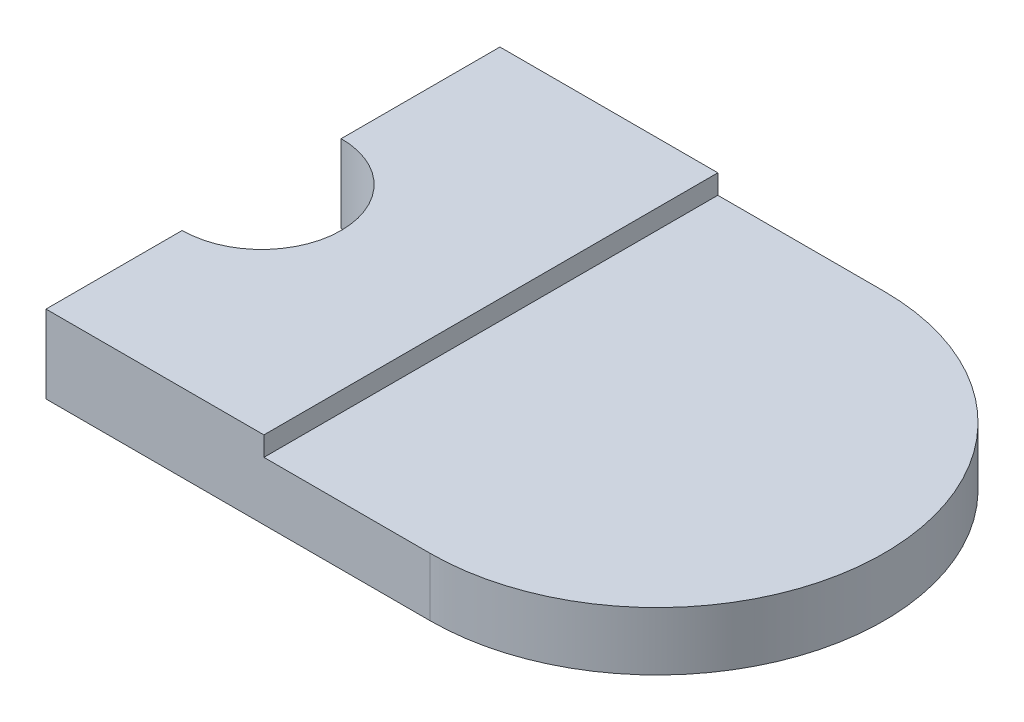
ISO-10303-21;
HEADER;
FILE_DESCRIPTION(('STEP AP214'),'2;1');
FILE_NAME('part.step','',(''),(''),'','','');
FILE_SCHEMA(('AUTOMOTIVE_DESIGN { 1 0 10303 214 1 1 1 1 }'));
ENDSEC;
DATA;
#1=APPLICATION_CONTEXT('core data for automotive mechanical design processes');
#2=APPLICATION_PROTOCOL_DEFINITION('international standard','automotive_design',2000,#1);
#3=PRODUCT_CONTEXT('',#1,'mechanical');
#4=PRODUCT('Part','Part','',(#3));
#5=PRODUCT_RELATED_PRODUCT_CATEGORY('part','',(#4));
#6=PRODUCT_DEFINITION_FORMATION('','',#4);
#7=PRODUCT_DEFINITION_CONTEXT('part definition',#1,'design');
#8=PRODUCT_DEFINITION('design','',#6,#7);
#9=PRODUCT_DEFINITION_SHAPE('','',#8);
#10=(LENGTH_UNIT() NAMED_UNIT(*) SI_UNIT(.MILLI.,.METRE.));
#11=(NAMED_UNIT(*) PLANE_ANGLE_UNIT() SI_UNIT($,.RADIAN.));
#12=(NAMED_UNIT(*) SI_UNIT($,.STERADIAN.) SOLID_ANGLE_UNIT());
#13=UNCERTAINTY_MEASURE_WITH_UNIT(LENGTH_MEASURE(1.E-05),#10,'distance_accuracy_value','');
#14=(GEOMETRIC_REPRESENTATION_CONTEXT(3) GLOBAL_UNCERTAINTY_ASSIGNED_CONTEXT((#13)) GLOBAL_UNIT_ASSIGNED_CONTEXT((#10,
#11,#12)) REPRESENTATION_CONTEXT('',''));
#15=CARTESIAN_POINT('',(0.,0.,0.));
#16=DIRECTION('',(0.,0.,1.));
#17=DIRECTION('',(1.,0.,0.));
#18=AXIS2_PLACEMENT_3D('',#15,#16,#17);
#19=CARTESIAN_POINT('',(0.,12.7,0.));
#20=DIRECTION('',(0.,0.,-1.));
#21=DIRECTION('',(-1.,0.,0.));
#22=AXIS2_PLACEMENT_3D('',#19,#20,#21);
#23=PLANE('',#22);
#24=DIRECTION('',(1.,0.,0.));
#25=VECTOR('',#24,1.);
#26=CARTESIAN_POINT('',(0.,0.,0.));
#27=LINE('',#26,#25);
#28=CARTESIAN_POINT('',(0.,0.,0.));
#29=VERTEX_POINT('',#28);
#30=CARTESIAN_POINT('',(35.5347794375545,0.,0.));
#31=VERTEX_POINT('',#30);
#32=EDGE_CURVE('E44',#29,#31,#27,.T.);
#33=ORIENTED_EDGE('',*,*,#32,.F.);
#34=DIRECTION('',(0.,-1.,0.));
#35=VECTOR('',#34,1.);
#36=CARTESIAN_POINT('',(0.,12.7,0.));
#37=LINE('',#36,#35);
#38=CARTESIAN_POINT('',(0.,-12.7,0.));
#39=VERTEX_POINT('',#38);
#40=EDGE_CURVE('E113',#29,#39,#37,.T.);
#41=ORIENTED_EDGE('',*,*,#40,.T.);
#42=DIRECTION('',(1.,0.,0.));
#43=VECTOR('',#42,1.);
#44=CARTESIAN_POINT('',(0.,-12.7,0.));
#45=LINE('',#44,#43);
#46=CARTESIAN_POINT('',(62.6371240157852,-12.7,0.));
#47=VERTEX_POINT('',#46);
#48=EDGE_CURVE('E135',#39,#47,#45,.T.);
#49=ORIENTED_EDGE('',*,*,#48,.T.);
#50=DIRECTION('',(0.,-1.,0.));
#51=VECTOR('',#50,1.);
#52=CARTESIAN_POINT('',(62.6371240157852,12.7,0.));
#53=LINE('',#52,#51);
#54=CARTESIAN_POINT('',(62.6371240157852,-3.175,0.));
#55=VERTEX_POINT('',#54);
#56=EDGE_CURVE('E115',#55,#47,#53,.T.);
#57=ORIENTED_EDGE('',*,*,#56,.F.);
#58=DIRECTION('',(1.,0.,0.));
#59=VECTOR('',#58,1.);
#60=CARTESIAN_POINT('',(0.,-3.175,0.));
#61=LINE('',#60,#59);
#62=CARTESIAN_POINT('',(35.5347794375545,-3.175,0.));
#63=VERTEX_POINT('',#62);
#64=EDGE_CURVE('E142',#63,#55,#61,.T.);
#65=ORIENTED_EDGE('',*,*,#64,.F.);
#66=DIRECTION('',(0.,1.,0.));
#67=VECTOR('',#66,1.);
#68=CARTESIAN_POINT('',(35.5347794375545,12.7,0.));
#69=LINE('',#68,#67);
#70=EDGE_CURVE('E140',#63,#31,#69,.T.);
#71=ORIENTED_EDGE('',*,*,#70,.T.);
#72=EDGE_LOOP('',(#33,#41,#49,#57,#65,#71));
#73=FACE_BOUND('',#72,.T.);
#74=ADVANCED_FACE('F30',(#73),#23,.F.);
#75=CARTESIAN_POINT('',(0.,12.7,-74.0208769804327));
#76=DIRECTION('',(0.,0.,1.));
#77=DIRECTION('',(1.,0.,0.));
#78=AXIS2_PLACEMENT_3D('',#75,#76,#77);
#79=PLANE('',#78);
#80=DIRECTION('',(-1.,0.,0.));
#81=VECTOR('',#80,1.);
#82=CARTESIAN_POINT('',(0.,0.,-74.0208769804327));
#83=LINE('',#82,#81);
#84=CARTESIAN_POINT('',(35.5347794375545,0.,-74.0208769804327));
#85=VERTEX_POINT('',#84);
#86=CARTESIAN_POINT('',(0.,0.,-74.0208769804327));
#87=VERTEX_POINT('',#86);
#88=EDGE_CURVE('E95',#85,#87,#83,.T.);
#89=ORIENTED_EDGE('',*,*,#88,.F.);
#90=DIRECTION('',(0.,-1.,0.));
#91=VECTOR('',#90,1.);
#92=CARTESIAN_POINT('',(35.5347794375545,12.7,-74.0208769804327));
#93=LINE('',#92,#91);
#94=CARTESIAN_POINT('',(35.5347794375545,-3.175,-74.0208769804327));
#95=VERTEX_POINT('',#94);
#96=EDGE_CURVE('E104',#85,#95,#93,.T.);
#97=ORIENTED_EDGE('',*,*,#96,.T.);
#98=DIRECTION('',(-1.,0.,0.));
#99=VECTOR('',#98,1.);
#100=CARTESIAN_POINT('',(0.,-3.175,-74.0208769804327));
#101=LINE('',#100,#99);
#102=CARTESIAN_POINT('',(62.6371240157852,-3.175,-74.0208769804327));
#103=VERTEX_POINT('',#102);
#104=EDGE_CURVE('E38',#103,#95,#101,.T.);
#105=ORIENTED_EDGE('',*,*,#104,.F.);
#106=DIRECTION('',(0.,-1.,0.));
#107=VECTOR('',#106,1.);
#108=CARTESIAN_POINT('',(62.6371240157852,12.7,-74.0208769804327));
#109=LINE('',#108,#107);
#110=CARTESIAN_POINT('',(62.6371240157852,-12.7,-74.0208769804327));
#111=VERTEX_POINT('',#110);
#112=EDGE_CURVE('E119',#103,#111,#109,.T.);
#113=ORIENTED_EDGE('',*,*,#112,.T.);
#114=DIRECTION('',(-1.,0.,0.));
#115=VECTOR('',#114,1.);
#116=CARTESIAN_POINT('',(0.,-12.7,-74.0208769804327));
#117=LINE('',#116,#115);
#118=CARTESIAN_POINT('',(0.,-12.7,-74.0208769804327));
#119=VERTEX_POINT('',#118);
#120=EDGE_CURVE('E130',#111,#119,#117,.T.);
#121=ORIENTED_EDGE('',*,*,#120,.T.);
#122=DIRECTION('',(0.,-1.,0.));
#123=VECTOR('',#122,1.);
#124=CARTESIAN_POINT('',(0.,12.7,-74.0208769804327));
#125=LINE('',#124,#123);
#126=EDGE_CURVE('E107',#87,#119,#125,.T.);
#127=ORIENTED_EDGE('',*,*,#126,.F.);
#128=EDGE_LOOP('',(#89,#97,#105,#113,#121,#127));
#129=FACE_BOUND('',#128,.T.);
#130=ADVANCED_FACE('F102',(#129),#79,.F.);
#131=CARTESIAN_POINT('',(0.,12.7,0.));
#132=DIRECTION('',(1.,0.,0.));
#133=DIRECTION('',(0.,0.,-1.));
#134=AXIS2_PLACEMENT_3D('',#131,#132,#133);
#135=PLANE('',#134);
#136=DIRECTION('',(0.,0.,1.));
#137=VECTOR('',#136,1.);
#138=CARTESIAN_POINT('',(0.,0.,0.));
#139=LINE('',#138,#137);
#140=CARTESIAN_POINT('',(0.,0.,-22.1991821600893));
#141=VERTEX_POINT('',#140);
#142=EDGE_CURVE('E149',#141,#29,#139,.T.);
#143=ORIENTED_EDGE('',*,*,#142,.F.);
#144=DIRECTION('',(0.,-1.,0.));
#145=VECTOR('',#144,1.);
#146=CARTESIAN_POINT('',(0.,12.7,-22.1991821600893));
#147=LINE('',#146,#145);
#148=CARTESIAN_POINT('',(0.,-12.7,-22.1991821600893));
#149=VERTEX_POINT('',#148);
#150=EDGE_CURVE('E52',#141,#149,#147,.T.);
#151=ORIENTED_EDGE('',*,*,#150,.T.);
#152=DIRECTION('',(0.,0.,1.));
#153=VECTOR('',#152,1.);
#154=CARTESIAN_POINT('',(0.,-12.7,0.));
#155=LINE('',#154,#153);
#156=EDGE_CURVE('E138',#149,#39,#155,.T.);
#157=ORIENTED_EDGE('',*,*,#156,.T.);
#158=ORIENTED_EDGE('',*,*,#40,.F.);
#159=EDGE_LOOP('',(#143,#151,#157,#158));
#160=FACE_BOUND('',#159,.T.);
#161=ADVANCED_FACE('F32',(#160),#135,.F.);
#162=CARTESIAN_POINT('',(0.,12.7,-48.1378847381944));
#163=DIRECTION('',(1.,0.,0.));
#164=DIRECTION('',(0.,0.,-1.));
#165=AXIS2_PLACEMENT_3D('',#162,#163,#164);
#166=PLANE('',#165);
#167=DIRECTION('',(0.,0.,1.));
#168=VECTOR('',#167,1.);
#169=CARTESIAN_POINT('',(0.,0.,-48.1378847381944));
#170=LINE('',#169,#168);
#171=CARTESIAN_POINT('',(0.,0.,-48.1378847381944));
#172=VERTEX_POINT('',#171);
#173=EDGE_CURVE('E151',#87,#172,#170,.T.);
#174=ORIENTED_EDGE('',*,*,#173,.F.);
#175=ORIENTED_EDGE('',*,*,#126,.T.);
#176=DIRECTION('',(0.,0.,1.));
#177=VECTOR('',#176,1.);
#178=CARTESIAN_POINT('',(0.,-12.7,-48.1378847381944));
#179=LINE('',#178,#177);
#180=CARTESIAN_POINT('',(0.,-12.7,-48.1378847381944));
#181=VERTEX_POINT('',#180);
#182=EDGE_CURVE('E127',#119,#181,#179,.T.);
#183=ORIENTED_EDGE('',*,*,#182,.T.);
#184=DIRECTION('',(0.,-1.,0.));
#185=VECTOR('',#184,1.);
#186=CARTESIAN_POINT('',(0.,12.7,-48.1378847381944));
#187=LINE('',#186,#185);
#188=EDGE_CURVE('E122',#172,#181,#187,.T.);
#189=ORIENTED_EDGE('',*,*,#188,.F.);
#190=EDGE_LOOP('',(#174,#175,#183,#189));
#191=FACE_BOUND('',#190,.T.);
#192=ADVANCED_FACE('F158',(#191),#166,.F.);
#193=CARTESIAN_POINT('',(0.,12.7,-35.1685334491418));
#194=DIRECTION('',(0.,-1.,0.));
#195=DIRECTION('',(0.,0.,-1.));
#196=AXIS2_PLACEMENT_3D('',#193,#194,#195);
#197=CYLINDRICAL_SURFACE('',#196,12.9693512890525);
#198=CARTESIAN_POINT('',(0.,0.,-35.1685334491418));
#199=DIRECTION('',(0.,1.,0.));
#200=DIRECTION('',(0.,0.,1.));
#201=AXIS2_PLACEMENT_3D('',#198,#199,#200);
#202=CIRCLE('',#201,12.9693512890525);
#203=EDGE_CURVE('E147',#172,#141,#202,.F.);
#204=ORIENTED_EDGE('',*,*,#203,.F.);
#205=ORIENTED_EDGE('',*,*,#188,.T.);
#206=CARTESIAN_POINT('',(0.,-12.7,-35.1685334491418));
#207=DIRECTION('',(0.,-1.,0.));
#208=DIRECTION('',(0.,0.,-1.));
#209=AXIS2_PLACEMENT_3D('',#206,#207,#208);
#210=CIRCLE('',#209,12.9693512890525);
#211=EDGE_CURVE('E125',#181,#149,#210,.T.);
#212=ORIENTED_EDGE('',*,*,#211,.T.);
#213=ORIENTED_EDGE('',*,*,#150,.F.);
#214=EDGE_LOOP('',(#204,#205,#212,#213));
#215=FACE_BOUND('',#214,.T.);
#216=ADVANCED_FACE('F157',(#215),#197,.F.);
#217=CARTESIAN_POINT('',(35.5347794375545,-3.175,-85.4025246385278));
#218=DIRECTION('',(-1.,0.,0.));
#219=DIRECTION('',(0.,0.,1.));
#220=AXIS2_PLACEMENT_3D('',#217,#218,#219);
#221=PLANE('',#220);
#222=DIRECTION('',(0.,0.,-1.));
#223=VECTOR('',#222,1.);
#224=CARTESIAN_POINT('',(35.5347794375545,0.,-85.4025246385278));
#225=LINE('',#224,#223);
#226=EDGE_CURVE('E11',#31,#85,#225,.T.);
#227=ORIENTED_EDGE('',*,*,#226,.F.);
#228=ORIENTED_EDGE('',*,*,#70,.F.);
#229=DIRECTION('',(0.,0.,1.));
#230=VECTOR('',#229,1.);
#231=CARTESIAN_POINT('',(35.5347794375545,-3.175,-85.4025246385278));
#232=LINE('',#231,#230);
#233=EDGE_CURVE('E112',#95,#63,#232,.T.);
#234=ORIENTED_EDGE('',*,*,#233,.F.);
#235=ORIENTED_EDGE('',*,*,#96,.F.);
#236=EDGE_LOOP('',(#227,#228,#234,#235));
#237=FACE_BOUND('',#236,.T.);
#238=ADVANCED_FACE('F110',(#237),#221,.F.);
#239=CARTESIAN_POINT('',(62.6371240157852,12.7,-37.0104384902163));
#240=DIRECTION('',(0.,-1.,0.));
#241=DIRECTION('',(0.,0.,-1.));
#242=AXIS2_PLACEMENT_3D('',#239,#240,#241);
#243=CYLINDRICAL_SURFACE('',#242,37.0104384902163);
#244=CARTESIAN_POINT('',(62.6371240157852,-3.175,-37.0104384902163));
#245=DIRECTION('',(0.,1.,0.));
#246=DIRECTION('',(0.,0.,1.));
#247=AXIS2_PLACEMENT_3D('',#244,#245,#246);
#248=CIRCLE('',#247,37.0104384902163);
#249=EDGE_CURVE('E144',#55,#103,#248,.T.);
#250=ORIENTED_EDGE('',*,*,#249,.F.);
#251=ORIENTED_EDGE('',*,*,#56,.T.);
#252=CARTESIAN_POINT('',(62.6371240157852,-12.7,-37.0104384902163));
#253=DIRECTION('',(0.,1.,0.));
#254=DIRECTION('',(0.,0.,-1.));
#255=AXIS2_PLACEMENT_3D('',#252,#253,#254);
#256=CIRCLE('',#255,37.0104384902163);
#257=EDGE_CURVE('E132',#47,#111,#256,.T.);
#258=ORIENTED_EDGE('',*,*,#257,.T.);
#259=ORIENTED_EDGE('',*,*,#112,.F.);
#260=EDGE_LOOP('',(#250,#251,#258,#259));
#261=FACE_BOUND('',#260,.T.);
#262=ADVANCED_FACE('F176',(#261),#243,.T.);
#263=CARTESIAN_POINT('',(0.,-12.7,-35.1685334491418));
#264=DIRECTION('',(0.,-1.,0.));
#265=DIRECTION('',(0.,0.,-1.));
#266=AXIS2_PLACEMENT_3D('',#263,#264,#265);
#267=PLANE('',#266);
#268=ORIENTED_EDGE('',*,*,#156,.F.);
#269=ORIENTED_EDGE('',*,*,#211,.F.);
#270=ORIENTED_EDGE('',*,*,#182,.F.);
#271=ORIENTED_EDGE('',*,*,#120,.F.);
#272=ORIENTED_EDGE('',*,*,#257,.F.);
#273=ORIENTED_EDGE('',*,*,#48,.F.);
#274=EDGE_LOOP('',(#268,#269,#270,#271,#272,#273));
#275=FACE_BOUND('',#274,.T.);
#276=ADVANCED_FACE('F164',(#275),#267,.T.);
#277=CARTESIAN_POINT('',(35.5347794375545,-3.175,17.0972483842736));
#278=DIRECTION('',(0.,1.,0.));
#279=DIRECTION('',(0.,0.,1.));
#280=AXIS2_PLACEMENT_3D('',#277,#278,#279);
#281=PLANE('',#280);
#282=ORIENTED_EDGE('',*,*,#64,.T.);
#283=ORIENTED_EDGE('',*,*,#249,.T.);
#284=ORIENTED_EDGE('',*,*,#104,.T.);
#285=ORIENTED_EDGE('',*,*,#233,.T.);
#286=EDGE_LOOP('',(#282,#283,#284,#285));
#287=FACE_BOUND('',#286,.T.);
#288=ADVANCED_FACE('F172',(#287),#281,.T.);
#289=CARTESIAN_POINT('',(-12.0952266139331,0.,14.8110080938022));
#290=DIRECTION('',(0.,1.,0.));
#291=DIRECTION('',(0.,0.,1.));
#292=AXIS2_PLACEMENT_3D('',#289,#290,#291);
#293=PLANE('',#292);
#294=ORIENTED_EDGE('',*,*,#203,.T.);
#295=ORIENTED_EDGE('',*,*,#142,.T.);
#296=ORIENTED_EDGE('',*,*,#32,.T.);
#297=ORIENTED_EDGE('',*,*,#226,.T.);
#298=ORIENTED_EDGE('',*,*,#88,.T.);
#299=ORIENTED_EDGE('',*,*,#173,.T.);
#300=EDGE_LOOP('',(#294,#295,#296,#297,#298,#299));
#301=FACE_BOUND('',#300,.T.);
#302=ADVANCED_FACE('F94',(#301),#293,.T.);
#303=CLOSED_SHELL('',(#74,#130,#161,#192,#216,#238,#262,#276,#288,#302));
#304=MANIFOLD_SOLID_BREP('B2',#303);
#305=ADVANCED_BREP_SHAPE_REPRESENTATION('',(#18,#304),#14);
#306=SHAPE_DEFINITION_REPRESENTATION(#9,#305);
ENDSEC;
END-ISO-10303-21;
